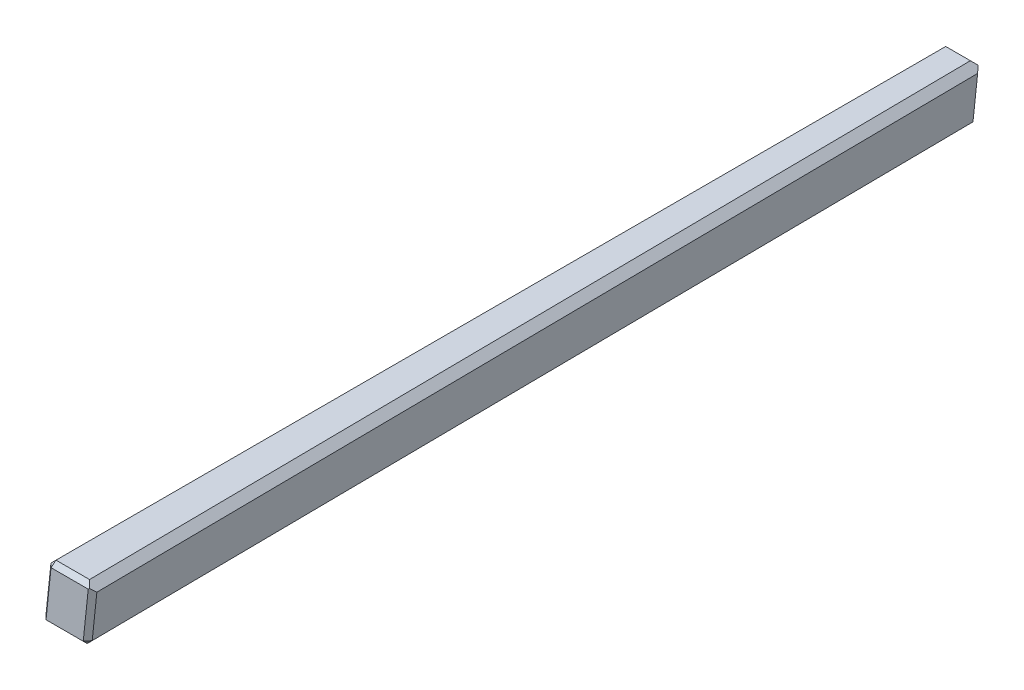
ISO-10303-21;
HEADER;
FILE_DESCRIPTION(('STEP AP214'),'2;1');
FILE_NAME('part.step','',(''),(''),'','','');
FILE_SCHEMA(('AUTOMOTIVE_DESIGN { 1 0 10303 214 1 1 1 1 }'));
ENDSEC;
DATA;
#1=APPLICATION_CONTEXT('core data for automotive mechanical design processes');
#2=APPLICATION_PROTOCOL_DEFINITION('international standard','automotive_design',2000,#1);
#3=PRODUCT_CONTEXT('',#1,'mechanical');
#4=PRODUCT('Part','Part','',(#3));
#5=PRODUCT_RELATED_PRODUCT_CATEGORY('part','',(#4));
#6=PRODUCT_DEFINITION_FORMATION('','',#4);
#7=PRODUCT_DEFINITION_CONTEXT('part definition',#1,'design');
#8=PRODUCT_DEFINITION('design','',#6,#7);
#9=PRODUCT_DEFINITION_SHAPE('','',#8);
#10=(LENGTH_UNIT() NAMED_UNIT(*) SI_UNIT(.MILLI.,.METRE.));
#11=(NAMED_UNIT(*) PLANE_ANGLE_UNIT() SI_UNIT($,.RADIAN.));
#12=(NAMED_UNIT(*) SI_UNIT($,.STERADIAN.) SOLID_ANGLE_UNIT());
#13=UNCERTAINTY_MEASURE_WITH_UNIT(LENGTH_MEASURE(1.E-05),#10,'distance_accuracy_value','');
#14=(GEOMETRIC_REPRESENTATION_CONTEXT(3) GLOBAL_UNCERTAINTY_ASSIGNED_CONTEXT((#13)) GLOBAL_UNIT_ASSIGNED_CONTEXT((#10,
#11,#12)) REPRESENTATION_CONTEXT('',''));
#15=CARTESIAN_POINT('',(0.,0.,0.));
#16=DIRECTION('',(0.,0.,1.));
#17=DIRECTION('',(1.,0.,0.));
#18=AXIS2_PLACEMENT_3D('',#15,#16,#17);
#19=CARTESIAN_POINT('',(0.,0.,-30.));
#20=DIRECTION('',(0.,0.,1.));
#21=DIRECTION('',(1.,0.,0.));
#22=AXIS2_PLACEMENT_3D('',#19,#20,#21);
#23=PLANE('',#22);
#24=DIRECTION('',(1.,0.,0.));
#25=VECTOR('',#24,1.);
#26=CARTESIAN_POINT('',(24.0107834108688,29.,-30.));
#27=LINE('',#26,#25);
#28=CARTESIAN_POINT('',(5.56179352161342,29.,-30.));
#29=VERTEX_POINT('',#28);
#30=CARTESIAN_POINT('',(21.2342521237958,29.,-30.));
#31=VERTEX_POINT('',#30);
#32=EDGE_CURVE('E186',#29,#31,#27,.T.);
#33=ORIENTED_EDGE('',*,*,#32,.T.);
#34=DIRECTION('',(-0.104528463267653,-0.994521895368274,0.));
#35=VECTOR('',#34,1.);
#36=CARTESIAN_POINT('',(18.2136952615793,0.261321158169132,-30.));
#37=LINE('',#36,#35);
#38=CARTESIAN_POINT('',(18.4489898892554,2.5,-30.));
#39=VERTEX_POINT('',#38);
#40=EDGE_CURVE('E188',#31,#39,#37,.T.);
#41=ORIENTED_EDGE('',*,*,#40,.T.);
#42=DIRECTION('',(-1.,0.,0.));
#43=VECTOR('',#42,1.);
#44=CARTESIAN_POINT('',(0.,2.5,-30.));
#45=LINE('',#44,#43);
#46=CARTESIAN_POINT('',(2.77653128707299,2.5,-30.));
#47=VERTEX_POINT('',#46);
#48=EDGE_CURVE('E182',#39,#47,#45,.T.);
#49=ORIENTED_EDGE('',*,*,#48,.T.);
#50=DIRECTION('',(0.104528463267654,0.994521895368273,0.));
#51=VECTOR('',#50,1.);
#52=CARTESIAN_POINT('',(5.7970881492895,31.2386788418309,-30.));
#53=LINE('',#52,#51);
#54=EDGE_CURVE('E184',#47,#29,#53,.T.);
#55=ORIENTED_EDGE('',*,*,#54,.T.);
#56=EDGE_LOOP('',(#33,#41,#49,#55));
#57=FACE_BOUND('',#56,.T.);
#58=ADVANCED_FACE('F44',(#57),#23,.F.);
#59=CARTESIAN_POINT('',(0.,0.,470.));
#60=DIRECTION('',(0.,0.,1.));
#61=DIRECTION('',(1.,0.,0.));
#62=AXIS2_PLACEMENT_3D('',#59,#60,#61);
#63=PLANE('',#62);
#64=DIRECTION('',(1.,0.,0.));
#65=VECTOR('',#64,1.);
#66=CARTESIAN_POINT('',(0.,2.5,470.));
#67=LINE('',#66,#65);
#68=CARTESIAN_POINT('',(2.77653128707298,2.5,470.));
#69=VERTEX_POINT('',#68);
#70=CARTESIAN_POINT('',(23.473620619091,2.5,470.));
#71=VERTEX_POINT('',#70);
#72=EDGE_CURVE('E191',#69,#71,#67,.T.);
#73=ORIENTED_EDGE('',*,*,#72,.T.);
#74=DIRECTION('',(0.104528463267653,0.994521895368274,0.));
#75=VECTOR('',#74,1.);
#76=CARTESIAN_POINT('',(22.9572535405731,-2.41290457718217,470.));
#77=LINE('',#76,#75);
#78=CARTESIAN_POINT('',(26.2588828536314,29.,470.));
#79=VERTEX_POINT('',#78);
#80=EDGE_CURVE('E149',#71,#79,#77,.T.);
#81=ORIENTED_EDGE('',*,*,#80,.T.);
#82=DIRECTION('',(-1.,0.,0.));
#83=VECTOR('',#82,1.);
#84=CARTESIAN_POINT('',(0.,29.,470.));
#85=LINE('',#84,#83);
#86=CARTESIAN_POINT('',(5.56179352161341,29.,470.));
#87=VERTEX_POINT('',#86);
#88=EDGE_CURVE('E195',#79,#87,#85,.T.);
#89=ORIENTED_EDGE('',*,*,#88,.T.);
#90=DIRECTION('',(-0.104528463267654,-0.994521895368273,0.));
#91=VECTOR('',#90,1.);
#92=CARTESIAN_POINT('',(2.48630473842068,-0.261321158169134,470.));
#93=LINE('',#92,#91);
#94=EDGE_CURVE('E193',#87,#69,#93,.T.);
#95=ORIENTED_EDGE('',*,*,#94,.T.);
#96=EDGE_LOOP('',(#73,#81,#89,#95));
#97=FACE_BOUND('',#96,.T.);
#98=ADVANCED_FACE('F329',(#97),#63,.T.);
#99=CARTESIAN_POINT('',(20.7684956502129,-2.18285685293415,-0.207684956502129));
#100=DIRECTION('',(0.994472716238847,-0.104523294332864,-0.00994472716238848));
#101=DIRECTION('',(0.104528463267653,0.994521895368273,0.));
#102=AXIS2_PLACEMENT_3D('',#99,#100,#101);
#103=PLANE('',#102);
#104=DIRECTION('',(0.104528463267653,0.994521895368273,0.));
#105=VECTOR('',#104,1.);
#106=CARTESIAN_POINT('',(24.0357586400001,31.4973749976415,-27.4748872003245));
#107=LINE('',#106,#105);
#108=CARTESIAN_POINT('',(21.0188708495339,2.7936050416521,-27.4748872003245));
#109=VERTEX_POINT('',#108);
#110=CARTESIAN_POINT('',(23.6080465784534,27.427966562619,-27.4748872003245));
#111=VERTEX_POINT('',#110);
#112=EDGE_CURVE('E141',#109,#111,#107,.T.);
#113=ORIENTED_EDGE('',*,*,#112,.T.);
#114=DIRECTION('',(0.00999950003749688,0.,0.999950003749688));
#115=VECTOR('',#114,1.);
#116=CARTESIAN_POINT('',(23.8804074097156,27.427966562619,-0.238804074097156));
#117=LINE('',#116,#115);
#118=CARTESIAN_POINT('',(28.5577966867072,27.427966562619,467.500123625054));
#119=VERTEX_POINT('',#118);
#120=EDGE_CURVE('E66',#111,#119,#117,.T.);
#121=ORIENTED_EDGE('',*,*,#120,.T.);
#122=DIRECTION('',(-0.104528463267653,-0.994521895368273,0.));
#123=VECTOR('',#122,1.);
#124=CARTESIAN_POINT('',(25.3944710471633,-2.66906645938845,467.500123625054));
#125=LINE('',#124,#123);
#126=CARTESIAN_POINT('',(25.9686209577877,2.79360504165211,467.500123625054));
#127=VERTEX_POINT('',#126);
#128=EDGE_CURVE('E135',#119,#127,#125,.T.);
#129=ORIENTED_EDGE('',*,*,#128,.T.);
#130=DIRECTION('',(-0.00999950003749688,0.,-0.999950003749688));
#131=VECTOR('',#130,1.);
#132=CARTESIAN_POINT('',(21.2914905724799,2.79360504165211,-0.212914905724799));
#133=LINE('',#132,#131);
#134=EDGE_CURVE('E139',#127,#109,#133,.T.);
#135=ORIENTED_EDGE('',*,*,#134,.T.);
#136=EDGE_LOOP('',(#113,#121,#129,#135));
#137=FACE_BOUND('',#136,.T.);
#138=ADVANCED_FACE('F137',(#137),#103,.T.);
#139=CARTESIAN_POINT('',(0.,31.5,0.));
#140=DIRECTION('',(0.,1.,0.));
#141=DIRECTION('',(-1.,0.,0.));
#142=AXIS2_PLACEMENT_3D('',#139,#140,#141);
#143=PLANE('',#142);
#144=DIRECTION('',(1.,0.,0.));
#145=VECTOR('',#144,1.);
#146=CARTESIAN_POINT('',(0.,31.5,467.5));
#147=LINE('',#146,#145);
#148=CARTESIAN_POINT('',(5.8107834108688,31.5,467.5));
#149=VERTEX_POINT('',#148);
#150=CARTESIAN_POINT('',(24.4855584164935,31.5,467.5));
#151=VERTEX_POINT('',#150);
#152=EDGE_CURVE('E179',#149,#151,#147,.T.);
#153=ORIENTED_EDGE('',*,*,#152,.T.);
#154=DIRECTION('',(-0.00999950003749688,0.,-0.999950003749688));
#155=VECTOR('',#154,1.);
#156=CARTESIAN_POINT('',(19.8085775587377,31.5,-0.198085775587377));
#157=LINE('',#156,#155);
#158=CARTESIAN_POINT('',(19.5355584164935,31.5,-27.5));
#159=VERTEX_POINT('',#158);
#160=EDGE_CURVE('E216',#151,#159,#157,.T.);
#161=ORIENTED_EDGE('',*,*,#160,.T.);
#162=DIRECTION('',(-1.,0.,0.));
#163=VECTOR('',#162,1.);
#164=CARTESIAN_POINT('',(3.31078341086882,31.5,-27.5));
#165=LINE('',#164,#163);
#166=CARTESIAN_POINT('',(5.8107834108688,31.5,-27.5));
#167=VERTEX_POINT('',#166);
#168=EDGE_CURVE('E177',#159,#167,#165,.T.);
#169=ORIENTED_EDGE('',*,*,#168,.T.);
#170=DIRECTION('',(0.,0.,1.));
#171=VECTOR('',#170,1.);
#172=CARTESIAN_POINT('',(5.8107834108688,31.5,0.));
#173=LINE('',#172,#171);
#174=EDGE_CURVE('E175',#167,#149,#173,.T.);
#175=ORIENTED_EDGE('',*,*,#174,.T.);
#176=EDGE_LOOP('',(#153,#161,#169,#175));
#177=FACE_BOUND('',#176,.T.);
#178=ADVANCED_FACE('F279',(#177),#143,.T.);
#179=CARTESIAN_POINT('',(0.,0.,0.));
#180=DIRECTION('',(0.,-1.,0.));
#181=DIRECTION('',(1.,0.,0.));
#182=AXIS2_PLACEMENT_3D('',#179,#180,#181);
#183=PLANE('',#182);
#184=DIRECTION('',(0.00999950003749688,0.,0.999950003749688));
#185=VECTOR('',#184,1.);
#186=CARTESIAN_POINT('',(18.4980252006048,0.,-0.184980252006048));
#187=LINE('',#186,#185);
#188=CARTESIAN_POINT('',(18.2248750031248,0.,-27.5));
#189=VERTEX_POINT('',#188);
#190=CARTESIAN_POINT('',(23.1748750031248,0.,467.5));
#191=VERTEX_POINT('',#190);
#192=EDGE_CURVE('E211',#189,#191,#187,.T.);
#193=ORIENTED_EDGE('',*,*,#192,.T.);
#194=DIRECTION('',(-1.,0.,0.));
#195=VECTOR('',#194,1.);
#196=CARTESIAN_POINT('',(0.,0.,467.5));
#197=LINE('',#196,#195);
#198=CARTESIAN_POINT('',(2.2746910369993,0.,467.5));
#199=VERTEX_POINT('',#198);
#200=EDGE_CURVE('E213',#191,#199,#197,.T.);
#201=ORIENTED_EDGE('',*,*,#200,.T.);
#202=DIRECTION('',(0.,0.,-1.));
#203=VECTOR('',#202,1.);
#204=CARTESIAN_POINT('',(2.2746910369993,0.,0.));
#205=LINE('',#204,#203);
#206=CARTESIAN_POINT('',(2.2746910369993,0.,-27.5));
#207=VERTEX_POINT('',#206);
#208=EDGE_CURVE('E207',#199,#207,#205,.T.);
#209=ORIENTED_EDGE('',*,*,#208,.T.);
#210=DIRECTION('',(1.,0.,0.));
#211=VECTOR('',#210,1.);
#212=CARTESIAN_POINT('',(20.7,0.,-27.5));
#213=LINE('',#212,#211);
#214=EDGE_CURVE('E209',#207,#189,#213,.T.);
#215=ORIENTED_EDGE('',*,*,#214,.T.);
#216=EDGE_LOOP('',(#193,#201,#209,#215));
#217=FACE_BOUND('',#216,.T.);
#218=ADVANCED_FACE('F334',(#217),#183,.T.);
#219=CARTESIAN_POINT('',(0.,0.,0.));
#220=DIRECTION('',(-0.994521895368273,0.104528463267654,0.));
#221=DIRECTION('',(-0.104528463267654,-0.994521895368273,0.));
#222=AXIS2_PLACEMENT_3D('',#219,#220,#221);
#223=PLANE('',#222);
#224=DIRECTION('',(-0.104528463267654,-0.994521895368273,0.));
#225=VECTOR('',#224,1.);
#226=CARTESIAN_POINT('',(0.,0.,-27.5));
#227=LINE('',#226,#225);
#228=CARTESIAN_POINT('',(3.0171619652,28.7063785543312,-27.5));
#229=VERTEX_POINT('',#228);
#230=CARTESIAN_POINT('',(0.261321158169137,2.48630473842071,-27.5));
#231=VERTEX_POINT('',#230);
#232=EDGE_CURVE('E200',#229,#231,#227,.T.);
#233=ORIENTED_EDGE('',*,*,#232,.T.);
#234=DIRECTION('',(0.,0.,1.));
#235=VECTOR('',#234,1.);
#236=CARTESIAN_POINT('',(0.261321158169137,2.48630473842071,0.));
#237=LINE('',#236,#235);
#238=CARTESIAN_POINT('',(0.261321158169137,2.48630473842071,467.5));
#239=VERTEX_POINT('',#238);
#240=EDGE_CURVE('E205',#231,#239,#237,.T.);
#241=ORIENTED_EDGE('',*,*,#240,.T.);
#242=DIRECTION('',(0.104528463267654,0.994521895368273,0.));
#243=VECTOR('',#242,1.);
#244=CARTESIAN_POINT('',(0.,0.,467.5));
#245=LINE('',#244,#243);
#246=CARTESIAN_POINT('',(3.0171619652,28.7063785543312,467.5));
#247=VERTEX_POINT('',#246);
#248=EDGE_CURVE('E202',#239,#247,#245,.T.);
#249=ORIENTED_EDGE('',*,*,#248,.T.);
#250=DIRECTION('',(0.,0.,-1.));
#251=VECTOR('',#250,1.);
#252=CARTESIAN_POINT('',(3.0171619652,28.7063785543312,0.));
#253=LINE('',#252,#251);
#254=EDGE_CURVE('E198',#247,#229,#253,.T.);
#255=ORIENTED_EDGE('',*,*,#254,.T.);
#256=EDGE_LOOP('',(#233,#241,#249,#255));
#257=FACE_BOUND('',#256,.T.);
#258=ADVANCED_FACE('F312',(#257),#223,.T.);
#259=CARTESIAN_POINT('',(2.77653128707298,2.5,470.));
#260=DIRECTION('',(-0.611200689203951,-0.49494055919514,0.617630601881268));
#261=DIRECTION('',(0.710797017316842,0.,0.703397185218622));
#262=AXIS2_PLACEMENT_3D('',#259,#260,#261);
#263=PLANE('',#262);
#264=DIRECTION('',(-0.14053322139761,-0.70008942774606,-0.70008942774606));
#265=VECTOR('',#264,1.);
#266=CARTESIAN_POINT('',(2.77653128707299,2.5,470.));
#267=LINE('',#266,#265);
#268=EDGE_CURVE('E253',#69,#199,#267,.T.);
#269=ORIENTED_EDGE('',*,*,#268,.F.);
#270=DIRECTION('',(0.709242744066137,0.00386181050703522,0.704953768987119));
#271=VECTOR('',#270,1.);
#272=CARTESIAN_POINT('',(2.77653128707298,2.5,470.));
#273=LINE('',#272,#271);
#274=EDGE_CURVE('E168',#239,#69,#273,.T.);
#275=ORIENTED_EDGE('',*,*,#274,.F.);
#276=DIRECTION('',(-0.629320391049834,0.777145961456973,0.));
#277=VECTOR('',#276,1.);
#278=CARTESIAN_POINT('',(1.25075743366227,1.2644526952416,467.5));
#279=LINE('',#278,#277);
#280=EDGE_CURVE('E171',#199,#239,#279,.T.);
#281=ORIENTED_EDGE('',*,*,#280,.F.);
#282=EDGE_LOOP('',(#269,#275,#281));
#283=FACE_BOUND('',#282,.T.);
#284=ADVANCED_FACE('F320',(#283),#263,.T.);
#285=CARTESIAN_POINT('',(0.,29.,470.));
#286=DIRECTION('',(0.,-0.707106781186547,-0.707106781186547));
#287=DIRECTION('',(-1.,0.,0.));
#288=AXIS2_PLACEMENT_3D('',#285,#286,#287);
#289=PLANE('',#288);
#290=DIRECTION('',(0.610748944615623,0.559904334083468,-0.559904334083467));
#291=VECTOR('',#290,1.);
#292=CARTESIAN_POINT('',(16.463944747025,20.0204866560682,478.979513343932));
#293=LINE('',#292,#291);
#294=CARTESIAN_POINT('',(26.6492331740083,29.3578538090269,469.642146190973));
#295=VERTEX_POINT('',#294);
#296=EDGE_CURVE('E251',#295,#79,#293,.F.);
#297=ORIENTED_EDGE('',*,*,#296,.F.);
#298=DIRECTION('',(-0.581199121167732,0.575416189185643,-0.575416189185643));
#299=VECTOR('',#298,1.);
#300=CARTESIAN_POINT('',(17.8866793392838,38.0332202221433,460.966779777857));
#301=LINE('',#300,#299);
#302=EDGE_CURVE('E12',#295,#151,#301,.T.);
#303=ORIENTED_EDGE('',*,*,#302,.T.);
#304=ORIENTED_EDGE('',*,*,#152,.F.);
#305=DIRECTION('',(-0.0702509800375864,-0.705359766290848,0.705359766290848));
#306=VECTOR('',#305,1.);
#307=CARTESIAN_POINT('',(5.56179352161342,29.,470.));
#308=LINE('',#307,#306);
#309=EDGE_CURVE('E248',#87,#149,#308,.F.);
#310=ORIENTED_EDGE('',*,*,#309,.F.);
#311=ORIENTED_EDGE('',*,*,#88,.F.);
#312=EDGE_LOOP('',(#297,#303,#304,#310,#311));
#313=FACE_BOUND('',#312,.T.);
#314=ADVANCED_FACE('F275',(#313),#289,.F.);
#315=CARTESIAN_POINT('',(2.48630473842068,-0.261321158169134,470.));
#316=DIRECTION('',(0.703233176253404,-0.0739127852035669,-0.707106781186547));
#317=DIRECTION('',(-0.104528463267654,-0.994521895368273,0.));
#318=AXIS2_PLACEMENT_3D('',#315,#316,#317);
#319=PLANE('',#318);
#320=ORIENTED_EDGE('',*,*,#274,.T.);
#321=ORIENTED_EDGE('',*,*,#94,.F.);
#322=DIRECTION('',(-0.710930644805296,-0.0820332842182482,-0.69846127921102));
#323=VECTOR('',#322,1.);
#324=CARTESIAN_POINT('',(5.56179352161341,29.,470.));
#325=LINE('',#324,#323);
#326=EDGE_CURVE('E245',#247,#87,#325,.F.);
#327=ORIENTED_EDGE('',*,*,#326,.F.);
#328=ORIENTED_EDGE('',*,*,#248,.F.);
#329=EDGE_LOOP('',(#320,#321,#327,#328));
#330=FACE_BOUND('',#329,.T.);
#331=ADVANCED_FACE('F325',(#330),#319,.F.);
#332=CARTESIAN_POINT('',(2.2746910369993,0.,0.));
#333=DIRECTION('',(0.777145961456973,0.629320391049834,0.));
#334=DIRECTION('',(0.,0.,-1.));
#335=AXIS2_PLACEMENT_3D('',#332,#333,#334);
#336=PLANE('',#335);
#337=ORIENTED_EDGE('',*,*,#280,.T.);
#338=ORIENTED_EDGE('',*,*,#240,.F.);
#339=DIRECTION('',(0.629320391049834,-0.777145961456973,0.));
#340=VECTOR('',#339,1.);
#341=CARTESIAN_POINT('',(0.261321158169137,2.48630473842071,-27.5));
#342=LINE('',#341,#340);
#343=EDGE_CURVE('E242',#207,#231,#342,.F.);
#344=ORIENTED_EDGE('',*,*,#343,.F.);
#345=ORIENTED_EDGE('',*,*,#208,.F.);
#346=EDGE_LOOP('',(#337,#338,#344,#345));
#347=FACE_BOUND('',#346,.T.);
#348=ADVANCED_FACE('F314',(#347),#336,.F.);
#349=CARTESIAN_POINT('',(0.,2.5,470.));
#350=DIRECTION('',(0.,0.707106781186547,-0.707106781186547));
#351=DIRECTION('',(1.,0.,0.));
#352=AXIS2_PLACEMENT_3D('',#349,#350,#351);
#353=PLANE('',#352);
#354=ORIENTED_EDGE('',*,*,#268,.T.);
#355=ORIENTED_EDGE('',*,*,#200,.F.);
#356=DIRECTION('',(0.0841979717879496,0.704595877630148,0.704595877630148));
#357=VECTOR('',#356,1.);
#358=CARTESIAN_POINT('',(23.3604201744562,1.5527020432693,469.052702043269));
#359=LINE('',#358,#357);
#360=EDGE_CURVE('E153',#71,#191,#359,.F.);
#361=ORIENTED_EDGE('',*,*,#360,.F.);
#362=ORIENTED_EDGE('',*,*,#72,.F.);
#363=EDGE_LOOP('',(#354,#355,#361,#362));
#364=FACE_BOUND('',#363,.T.);
#365=ADVANCED_FACE('F331',(#364),#353,.F.);
#366=CARTESIAN_POINT('',(22.957253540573,-2.41290457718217,470.));
#367=DIRECTION('',(-0.710191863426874,0.0746441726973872,-0.700039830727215));
#368=DIRECTION('',(0.104528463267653,0.994521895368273,0.));
#369=AXIS2_PLACEMENT_3D('',#366,#367,#368);
#370=PLANE('',#369);
#371=ORIENTED_EDGE('',*,*,#128,.F.);
#372=DIRECTION('',(-0.551982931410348,0.558150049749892,0.619502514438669));
#373=VECTOR('',#372,1.);
#374=CARTESIAN_POINT('',(35.1902026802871,20.7214589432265,460.05642934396));
#375=LINE('',#374,#373);
#376=EDGE_CURVE('E52',#119,#295,#375,.T.);
#377=ORIENTED_EDGE('',*,*,#376,.T.);
#378=ORIENTED_EDGE('',*,*,#296,.T.);
#379=ORIENTED_EDGE('',*,*,#80,.F.);
#380=DIRECTION('',(0.703987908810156,0.082843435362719,-0.705363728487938));
#381=VECTOR('',#380,1.);
#382=CARTESIAN_POINT('',(25.9686209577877,2.79360504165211,467.500123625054));
#383=LINE('',#382,#381);
#384=EDGE_CURVE('E145',#127,#71,#383,.F.);
#385=ORIENTED_EDGE('',*,*,#384,.F.);
#386=EDGE_LOOP('',(#371,#377,#378,#379,#385));
#387=FACE_BOUND('',#386,.T.);
#388=ADVANCED_FACE('F147',(#387),#370,.F.);
#389=CARTESIAN_POINT('',(5.56179352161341,29.,470.));
#390=DIRECTION('',(-0.596472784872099,0.596472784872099,0.537066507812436));
#391=DIRECTION('',(-0.707106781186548,-0.707106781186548,0.));
#392=AXIS2_PLACEMENT_3D('',#389,#390,#391);
#393=PLANE('',#392);
#394=ORIENTED_EDGE('',*,*,#326,.T.);
#395=ORIENTED_EDGE('',*,*,#309,.T.);
#396=DIRECTION('',(0.707106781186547,0.707106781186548,0.));
#397=VECTOR('',#396,1.);
#398=CARTESIAN_POINT('',(4.43628846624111,30.1255050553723,467.5));
#399=LINE('',#398,#397);
#400=EDGE_CURVE('E154',#247,#149,#399,.T.);
#401=ORIENTED_EDGE('',*,*,#400,.F.);
#402=EDGE_LOOP('',(#394,#395,#401));
#403=FACE_BOUND('',#402,.T.);
#404=ADVANCED_FACE('F327',(#403),#393,.T.);
#405=CARTESIAN_POINT('',(0.261321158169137,2.48630473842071,-27.5));
#406=DIRECTION('',(-0.611200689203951,-0.49494055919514,-0.617630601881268));
#407=DIRECTION('',(-0.710797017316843,0.,0.703397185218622));
#408=AXIS2_PLACEMENT_3D('',#405,#406,#407);
#409=PLANE('',#408);
#410=DIRECTION('',(-0.140533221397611,-0.700089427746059,0.700089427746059));
#411=VECTOR('',#410,1.);
#412=CARTESIAN_POINT('',(2.47954495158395,1.02051357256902,-28.520513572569));
#413=LINE('',#412,#411);
#414=EDGE_CURVE('E161',#207,#47,#413,.F.);
#415=ORIENTED_EDGE('',*,*,#414,.F.);
#416=ORIENTED_EDGE('',*,*,#343,.T.);
#417=DIRECTION('',(0.709242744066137,0.00386181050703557,-0.704953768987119));
#418=VECTOR('',#417,1.);
#419=CARTESIAN_POINT('',(0.261321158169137,2.48630473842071,-27.5));
#420=LINE('',#419,#418);
#421=EDGE_CURVE('E236',#47,#231,#420,.F.);
#422=ORIENTED_EDGE('',*,*,#421,.F.);
#423=EDGE_LOOP('',(#415,#416,#422));
#424=FACE_BOUND('',#423,.T.);
#425=ADVANCED_FACE('F305',(#424),#409,.T.);
#426=CARTESIAN_POINT('',(25.9686209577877,2.79360504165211,467.500123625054));
#427=DIRECTION('',(0.600233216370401,-0.60028688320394,0.528560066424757));
#428=DIRECTION('',(0.707138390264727,0.707075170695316,0.));
#429=AXIS2_PLACEMENT_3D('',#426,#427,#428);
#430=PLANE('',#429);
#431=ORIENTED_EDGE('',*,*,#384,.T.);
#432=ORIENTED_EDGE('',*,*,#360,.T.);
#433=DIRECTION('',(-0.707124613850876,-0.70708894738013,-3.12907187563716E-05));
#434=VECTOR('',#433,1.);
#435=CARTESIAN_POINT('',(25.9686209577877,2.79360504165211,467.500123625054));
#436=LINE('',#435,#434);
#437=EDGE_CURVE('E157',#127,#191,#436,.T.);
#438=ORIENTED_EDGE('',*,*,#437,.F.);
#439=EDGE_LOOP('',(#431,#432,#438));
#440=FACE_BOUND('',#439,.T.);
#441=ADVANCED_FACE('F158',(#440),#430,.T.);
#442=CARTESIAN_POINT('',(3.0171619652,28.7063785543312,0.));
#443=DIRECTION('',(0.707106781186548,-0.707106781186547,0.));
#444=DIRECTION('',(0.,0.,-1.));
#445=AXIS2_PLACEMENT_3D('',#442,#443,#444);
#446=PLANE('',#445);
#447=ORIENTED_EDGE('',*,*,#400,.T.);
#448=ORIENTED_EDGE('',*,*,#174,.F.);
#449=DIRECTION('',(-0.707106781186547,-0.707106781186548,0.));
#450=VECTOR('',#449,1.);
#451=CARTESIAN_POINT('',(5.8107834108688,31.5,-27.5));
#452=LINE('',#451,#450);
#453=EDGE_CURVE('E162',#229,#167,#452,.F.);
#454=ORIENTED_EDGE('',*,*,#453,.F.);
#455=ORIENTED_EDGE('',*,*,#254,.F.);
#456=EDGE_LOOP('',(#447,#448,#454,#455));
#457=FACE_BOUND('',#456,.T.);
#458=ADVANCED_FACE('F284',(#457),#446,.F.);
#459=CARTESIAN_POINT('',(0.,0.,-27.5));
#460=DIRECTION('',(-0.703233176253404,0.0739127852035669,-0.707106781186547));
#461=DIRECTION('',(0.104528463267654,0.994521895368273,0.));
#462=AXIS2_PLACEMENT_3D('',#459,#460,#461);
#463=PLANE('',#462);
#464=ORIENTED_EDGE('',*,*,#421,.T.);
#465=ORIENTED_EDGE('',*,*,#232,.F.);
#466=DIRECTION('',(-0.710930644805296,-0.0820332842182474,0.69846127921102));
#467=VECTOR('',#466,1.);
#468=CARTESIAN_POINT('',(4.59204470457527,28.8881020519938,-29.047260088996));
#469=LINE('',#468,#467);
#470=EDGE_CURVE('E229',#29,#229,#469,.T.);
#471=ORIENTED_EDGE('',*,*,#470,.F.);
#472=ORIENTED_EDGE('',*,*,#54,.F.);
#473=EDGE_LOOP('',(#464,#465,#471,#472));
#474=FACE_BOUND('',#473,.T.);
#475=ADVANCED_FACE('F309',(#474),#463,.T.);
#476=CARTESIAN_POINT('',(0.,0.,-27.5));
#477=DIRECTION('',(0.,-0.707106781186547,-0.707106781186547));
#478=DIRECTION('',(-1.,0.,0.));
#479=AXIS2_PLACEMENT_3D('',#476,#477,#478);
#480=PLANE('',#479);
#481=ORIENTED_EDGE('',*,*,#414,.T.);
#482=ORIENTED_EDGE('',*,*,#48,.F.);
#483=DIRECTION('',(0.0632622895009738,0.705690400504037,-0.705690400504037));
#484=VECTOR('',#483,1.);
#485=CARTESIAN_POINT('',(18.4489898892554,2.5,-30.));
#486=LINE('',#485,#484);
#487=EDGE_CURVE('E226',#189,#39,#486,.T.);
#488=ORIENTED_EDGE('',*,*,#487,.F.);
#489=ORIENTED_EDGE('',*,*,#214,.F.);
#490=EDGE_LOOP('',(#481,#482,#488,#489));
#491=FACE_BOUND('',#490,.T.);
#492=ADVANCED_FACE('F301',(#491),#480,.T.);
#493=CARTESIAN_POINT('',(21.2914905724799,2.7936050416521,-0.212914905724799));
#494=DIRECTION('',(-0.707071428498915,0.70710678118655,0.00707071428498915));
#495=DIRECTION('',(-0.00999950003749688,0.,-0.999950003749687));
#496=AXIS2_PLACEMENT_3D('',#493,#494,#495);
#497=PLANE('',#496);
#498=ORIENTED_EDGE('',*,*,#437,.T.);
#499=ORIENTED_EDGE('',*,*,#192,.F.);
#500=DIRECTION('',(0.707141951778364,0.707043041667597,0.0063558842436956));
#501=VECTOR('',#500,1.);
#502=CARTESIAN_POINT('',(19.5756568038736,1.35059286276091,-27.4878589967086));
#503=LINE('',#502,#501);
#504=EDGE_CURVE('E166',#109,#189,#503,.F.);
#505=ORIENTED_EDGE('',*,*,#504,.F.);
#506=ORIENTED_EDGE('',*,*,#134,.F.);
#507=EDGE_LOOP('',(#498,#499,#505,#506));
#508=FACE_BOUND('',#507,.T.);
#509=ADVANCED_FACE('F164',(#508),#497,.F.);
#510=CARTESIAN_POINT('',(5.8107834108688,31.5,-27.5));
#511=DIRECTION('',(-0.596472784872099,0.596472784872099,-0.537066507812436));
#512=DIRECTION('',(-0.707106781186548,-0.707106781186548,0.));
#513=AXIS2_PLACEMENT_3D('',#510,#511,#512);
#514=PLANE('',#513);
#515=ORIENTED_EDGE('',*,*,#470,.T.);
#516=ORIENTED_EDGE('',*,*,#453,.T.);
#517=DIRECTION('',(-0.0702509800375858,-0.705359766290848,-0.705359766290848));
#518=VECTOR('',#517,1.);
#519=CARTESIAN_POINT('',(5.81078341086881,31.5,-27.5));
#520=LINE('',#519,#518);
#521=EDGE_CURVE('E222',#29,#167,#520,.F.);
#522=ORIENTED_EDGE('',*,*,#521,.F.);
#523=EDGE_LOOP('',(#515,#516,#522));
#524=FACE_BOUND('',#523,.T.);
#525=ADVANCED_FACE('F288',(#524),#514,.T.);
#526=CARTESIAN_POINT('',(18.4489898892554,2.5,-30.));
#527=DIRECTION('',(0.597783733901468,-0.593018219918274,-0.539429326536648));
#528=DIRECTION('',(0.704271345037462,0.709930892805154,0.));
#529=AXIS2_PLACEMENT_3D('',#526,#527,#528);
#530=PLANE('',#529);
#531=ORIENTED_EDGE('',*,*,#504,.T.);
#532=ORIENTED_EDGE('',*,*,#487,.T.);
#533=DIRECTION('',(0.710935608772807,0.0812233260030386,0.698550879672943));
#534=VECTOR('',#533,1.);
#535=CARTESIAN_POINT('',(18.4489898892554,2.5,-30.));
#536=LINE('',#535,#534);
#537=EDGE_CURVE('E220',#109,#39,#536,.F.);
#538=ORIENTED_EDGE('',*,*,#537,.F.);
#539=EDGE_LOOP('',(#531,#532,#538));
#540=FACE_BOUND('',#539,.T.);
#541=ADVANCED_FACE('F298',(#540),#530,.T.);
#542=CARTESIAN_POINT('',(0.,31.5,-27.5));
#543=DIRECTION('',(0.,0.707106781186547,-0.707106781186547));
#544=DIRECTION('',(1.,0.,0.));
#545=AXIS2_PLACEMENT_3D('',#542,#543,#544);
#546=PLANE('',#545);
#547=ORIENTED_EDGE('',*,*,#168,.F.);
#548=DIRECTION('',(-0.573501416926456,0.579265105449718,0.579265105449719));
#549=VECTOR('',#548,1.);
#550=CARTESIAN_POINT('',(13.1102375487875,37.9898953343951,-21.0101046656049));
#551=LINE('',#550,#549);
#552=CARTESIAN_POINT('',(21.6447484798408,29.3696125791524,-29.6303874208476));
#553=VERTEX_POINT('',#552);
#554=EDGE_CURVE('E260',#159,#553,#551,.F.);
#555=ORIENTED_EDGE('',*,*,#554,.T.);
#556=DIRECTION('',(-0.617630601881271,-0.556117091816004,-0.556117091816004));
#557=VECTOR('',#556,1.);
#558=CARTESIAN_POINT('',(14.8514484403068,23.2528977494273,-35.7471022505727));
#559=LINE('',#558,#557);
#560=EDGE_CURVE('E217',#31,#553,#559,.F.);
#561=ORIENTED_EDGE('',*,*,#560,.F.);
#562=ORIENTED_EDGE('',*,*,#32,.F.);
#563=ORIENTED_EDGE('',*,*,#521,.T.);
#564=EDGE_LOOP('',(#547,#555,#561,#562,#563));
#565=FACE_BOUND('',#564,.T.);
#566=ADVANCED_FACE('F292',(#565),#546,.T.);
#567=CARTESIAN_POINT('',(20.4988028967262,-2.15451100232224,-27.4748872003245));
#568=DIRECTION('',(0.703233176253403,-0.0739127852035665,-0.707106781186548));
#569=DIRECTION('',(-0.104528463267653,-0.994521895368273,0.));
#570=AXIS2_PLACEMENT_3D('',#567,#568,#569);
#571=PLANE('',#570);
#572=ORIENTED_EDGE('',*,*,#560,.T.);
#573=DIRECTION('',(-0.560468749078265,0.55428766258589,-0.615337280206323));
#574=VECTOR('',#573,1.);
#575=CARTESIAN_POINT('',(31.821474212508,19.3051200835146,-18.4573849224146));
#576=LINE('',#575,#574);
#577=EDGE_CURVE('E262',#553,#111,#576,.F.);
#578=ORIENTED_EDGE('',*,*,#577,.T.);
#579=ORIENTED_EDGE('',*,*,#112,.F.);
#580=ORIENTED_EDGE('',*,*,#537,.T.);
#581=ORIENTED_EDGE('',*,*,#40,.F.);
#582=EDGE_LOOP('',(#572,#578,#579,#580,#581));
#583=FACE_BOUND('',#582,.T.);
#584=ADVANCED_FACE('F267',(#583),#571,.T.);
#585=CARTESIAN_POINT('',(19.8085775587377,31.5,-0.198085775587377));
#586=DIRECTION('',(-0.707071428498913,-0.707106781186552,0.00707071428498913));
#587=DIRECTION('',(-0.00999950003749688,0.,-0.999950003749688));
#588=AXIS2_PLACEMENT_3D('',#585,#586,#587);
#589=PLANE('',#588);
#590=ORIENTED_EDGE('',*,*,#376,.F.);
#591=ORIENTED_EDGE('',*,*,#120,.F.);
#592=ORIENTED_EDGE('',*,*,#577,.F.);
#593=ORIENTED_EDGE('',*,*,#554,.F.);
#594=ORIENTED_EDGE('',*,*,#160,.F.);
#595=ORIENTED_EDGE('',*,*,#302,.F.);
#596=EDGE_LOOP('',(#590,#591,#592,#593,#594,#595));
#597=FACE_BOUND('',#596,.T.);
#598=ADVANCED_FACE('F46',(#597),#589,.F.);
#599=CLOSED_SHELL('',(#58,#98,#138,#178,#218,#258,#284,#314,#331,#348,#365,#388,#404,#425,#441,
#458,#475,#492,#509,#525,#541,#566,#584,#598));
#600=MANIFOLD_SOLID_BREP('B2',#599);
#601=ADVANCED_BREP_SHAPE_REPRESENTATION('',(#18,#600),#14);
#602=SHAPE_DEFINITION_REPRESENTATION(#9,#601);
ENDSEC;
END-ISO-10303-21;
